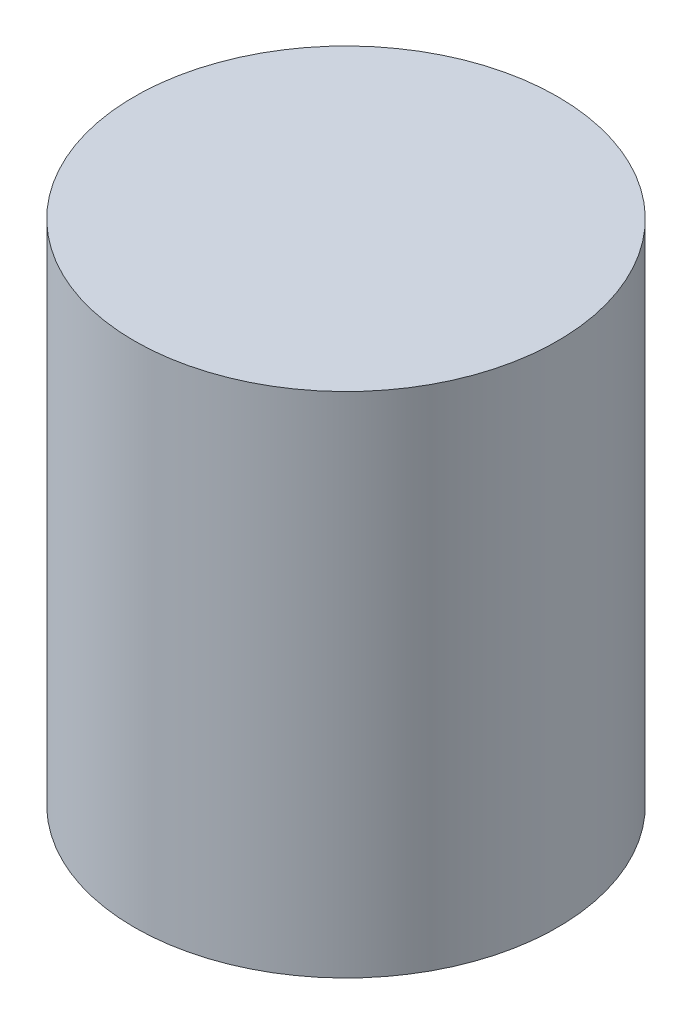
from build123d import *

# Parameters (mm, degrees)
ESQUISSE1_R      = 50
EXTRUSION1_DEPTH = 120


with BuildPart() as part:
    # Esquisse1 → Extrusion1 (new body)
    with BuildSketch(Plane(origin=(0, 0, 0), x_dir=(1, 0, 0), z_dir=(0, 1, 0))):
        with Locations(Location((0, 0, 0), (0, 0, 270))):
            Circle(ESQUISSE1_R)
    extrude(amount=EXTRUSION1_DEPTH)


solid = part.part
